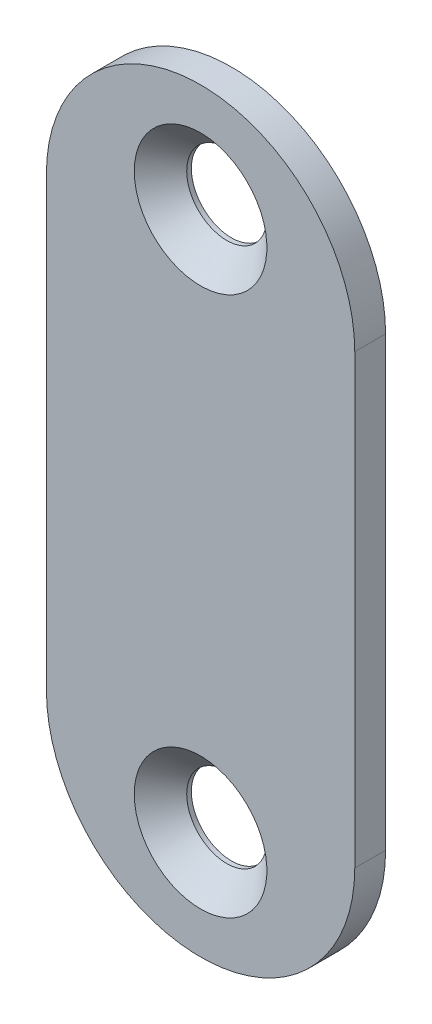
ISO-10303-21;
HEADER;
FILE_DESCRIPTION(('STEP AP214'),'2;1');
FILE_NAME('part.step','',(''),(''),'','','');
FILE_SCHEMA(('AUTOMOTIVE_DESIGN { 1 0 10303 214 1 1 1 1 }'));
ENDSEC;
DATA;
#1=APPLICATION_CONTEXT('core data for automotive mechanical design processes');
#2=APPLICATION_PROTOCOL_DEFINITION('international standard','automotive_design',2000,#1);
#3=PRODUCT_CONTEXT('',#1,'mechanical');
#4=PRODUCT('Part','Part','',(#3));
#5=PRODUCT_RELATED_PRODUCT_CATEGORY('part','',(#4));
#6=PRODUCT_DEFINITION_FORMATION('','',#4);
#7=PRODUCT_DEFINITION_CONTEXT('part definition',#1,'design');
#8=PRODUCT_DEFINITION('design','',#6,#7);
#9=PRODUCT_DEFINITION_SHAPE('','',#8);
#10=(LENGTH_UNIT() NAMED_UNIT(*) SI_UNIT(.MILLI.,.METRE.));
#11=(NAMED_UNIT(*) PLANE_ANGLE_UNIT() SI_UNIT($,.RADIAN.));
#12=(NAMED_UNIT(*) SI_UNIT($,.STERADIAN.) SOLID_ANGLE_UNIT());
#13=UNCERTAINTY_MEASURE_WITH_UNIT(LENGTH_MEASURE(1.E-05),#10,'distance_accuracy_value','');
#14=(GEOMETRIC_REPRESENTATION_CONTEXT(3) GLOBAL_UNCERTAINTY_ASSIGNED_CONTEXT((#13)) GLOBAL_UNIT_ASSIGNED_CONTEXT((#10,
#11,#12)) REPRESENTATION_CONTEXT('',''));
#15=CARTESIAN_POINT('',(0.,0.,0.));
#16=DIRECTION('',(0.,0.,1.));
#17=DIRECTION('',(1.,0.,0.));
#18=AXIS2_PLACEMENT_3D('',#15,#16,#17);
#19=CARTESIAN_POINT('',(0.,-14.5,-2.));
#20=DIRECTION('',(0.,0.,1.));
#21=DIRECTION('',(1.,0.,0.));
#22=AXIS2_PLACEMENT_3D('',#19,#20,#21);
#23=PLANE('',#22);
#24=CARTESIAN_POINT('',(0.,17.5,-2.));
#25=DIRECTION('',(0.,0.,1.));
#26=DIRECTION('',(1.,0.,0.));
#27=AXIS2_PLACEMENT_3D('',#24,#25,#26);
#28=CIRCLE('',#27,2.6);
#29=CARTESIAN_POINT('',(2.6,17.5,-2.));
#30=VERTEX_POINT('',#29);
#31=EDGE_CURVE('E106',#30,#30,#28,.F.);
#32=ORIENTED_EDGE('',*,*,#31,.F.);
#33=EDGE_LOOP('',(#32));
#34=FACE_BOUND('',#33,.T.);
#35=CARTESIAN_POINT('',(0.,-14.5,-2.));
#36=DIRECTION('',(0.,0.,1.));
#37=DIRECTION('',(1.,0.,0.));
#38=AXIS2_PLACEMENT_3D('',#35,#36,#37);
#39=CIRCLE('',#38,10.);
#40=CARTESIAN_POINT('',(-10.,-14.5,-2.));
#41=VERTEX_POINT('',#40);
#42=CARTESIAN_POINT('',(10.,-14.5,-2.));
#43=VERTEX_POINT('',#42);
#44=EDGE_CURVE('E95',#41,#43,#39,.T.);
#45=ORIENTED_EDGE('',*,*,#44,.F.);
#46=DIRECTION('',(0.,-1.,0.));
#47=VECTOR('',#46,1.);
#48=CARTESIAN_POINT('',(-10.,14.5,-2.));
#49=LINE('',#48,#47);
#50=CARTESIAN_POINT('',(-10.,14.5,-2.));
#51=VERTEX_POINT('',#50);
#52=EDGE_CURVE('E92',#51,#41,#49,.T.);
#53=ORIENTED_EDGE('',*,*,#52,.F.);
#54=CARTESIAN_POINT('',(0.,14.5,-2.));
#55=DIRECTION('',(0.,0.,1.));
#56=DIRECTION('',(1.,0.,0.));
#57=AXIS2_PLACEMENT_3D('',#54,#55,#56);
#58=CIRCLE('',#57,10.);
#59=CARTESIAN_POINT('',(10.,14.5,-2.));
#60=VERTEX_POINT('',#59);
#61=EDGE_CURVE('E84',#60,#51,#58,.T.);
#62=ORIENTED_EDGE('',*,*,#61,.F.);
#63=DIRECTION('',(0.,1.,0.));
#64=VECTOR('',#63,1.);
#65=CARTESIAN_POINT('',(10.,-14.5,-2.));
#66=LINE('',#65,#64);
#67=EDGE_CURVE('E91',#43,#60,#66,.T.);
#68=ORIENTED_EDGE('',*,*,#67,.F.);
#69=EDGE_LOOP('',(#45,#53,#62,#68));
#70=FACE_BOUND('',#69,.T.);
#71=CARTESIAN_POINT('',(0.,-17.5,-2.));
#72=DIRECTION('',(0.,0.,1.));
#73=DIRECTION('',(1.,0.,0.));
#74=AXIS2_PLACEMENT_3D('',#71,#72,#73);
#75=CIRCLE('',#74,2.6);
#76=CARTESIAN_POINT('',(2.6,-17.5,-2.));
#77=VERTEX_POINT('',#76);
#78=EDGE_CURVE('E38',#77,#77,#75,.F.);
#79=ORIENTED_EDGE('',*,*,#78,.F.);
#80=EDGE_LOOP('',(#79));
#81=FACE_BOUND('',#80,.T.);
#82=ADVANCED_FACE('F34',(#34,#70,#81),#23,.F.);
#83=CARTESIAN_POINT('',(0.,-14.5,0.));
#84=DIRECTION('',(0.,0.,1.));
#85=DIRECTION('',(1.,0.,0.));
#86=AXIS2_PLACEMENT_3D('',#83,#84,#85);
#87=PLANE('',#86);
#88=CARTESIAN_POINT('',(0.,17.5,0.));
#89=DIRECTION('',(0.,0.,-1.));
#90=DIRECTION('',(-1.,0.,0.));
#91=AXIS2_PLACEMENT_3D('',#88,#89,#90);
#92=CIRCLE('',#91,4.3);
#93=CARTESIAN_POINT('',(-4.3,17.5,0.));
#94=VERTEX_POINT('',#93);
#95=EDGE_CURVE('E117',#94,#94,#92,.T.);
#96=ORIENTED_EDGE('',*,*,#95,.T.);
#97=EDGE_LOOP('',(#96));
#98=FACE_BOUND('',#97,.T.);
#99=CARTESIAN_POINT('',(0.,-14.5,0.));
#100=DIRECTION('',(0.,0.,1.));
#101=DIRECTION('',(1.,0.,0.));
#102=AXIS2_PLACEMENT_3D('',#99,#100,#101);
#103=CIRCLE('',#102,10.);
#104=CARTESIAN_POINT('',(-10.,-14.5,0.));
#105=VERTEX_POINT('',#104);
#106=CARTESIAN_POINT('',(10.,-14.5,0.));
#107=VERTEX_POINT('',#106);
#108=EDGE_CURVE('E102',#105,#107,#103,.T.);
#109=ORIENTED_EDGE('',*,*,#108,.T.);
#110=DIRECTION('',(0.,1.,0.));
#111=VECTOR('',#110,1.);
#112=CARTESIAN_POINT('',(10.,-14.5,0.));
#113=LINE('',#112,#111);
#114=CARTESIAN_POINT('',(10.,14.5,0.));
#115=VERTEX_POINT('',#114);
#116=EDGE_CURVE('E105',#107,#115,#113,.T.);
#117=ORIENTED_EDGE('',*,*,#116,.T.);
#118=CARTESIAN_POINT('',(0.,14.5,0.));
#119=DIRECTION('',(0.,0.,1.));
#120=DIRECTION('',(1.,0.,0.));
#121=AXIS2_PLACEMENT_3D('',#118,#119,#120);
#122=CIRCLE('',#121,10.);
#123=CARTESIAN_POINT('',(-10.,14.5,0.));
#124=VERTEX_POINT('',#123);
#125=EDGE_CURVE('E86',#115,#124,#122,.T.);
#126=ORIENTED_EDGE('',*,*,#125,.T.);
#127=DIRECTION('',(0.,-1.,0.));
#128=VECTOR('',#127,1.);
#129=CARTESIAN_POINT('',(-10.,14.5,0.));
#130=LINE('',#129,#128);
#131=EDGE_CURVE('E97',#124,#105,#130,.T.);
#132=ORIENTED_EDGE('',*,*,#131,.T.);
#133=EDGE_LOOP('',(#109,#117,#126,#132));
#134=FACE_BOUND('',#133,.T.);
#135=CARTESIAN_POINT('',(0.,-17.5,0.));
#136=DIRECTION('',(0.,0.,-1.));
#137=DIRECTION('',(-1.,0.,0.));
#138=AXIS2_PLACEMENT_3D('',#135,#136,#137);
#139=CIRCLE('',#138,4.3);
#140=CARTESIAN_POINT('',(-4.3,-17.5,0.));
#141=VERTEX_POINT('',#140);
#142=EDGE_CURVE('E126',#141,#141,#139,.T.);
#143=ORIENTED_EDGE('',*,*,#142,.T.);
#144=EDGE_LOOP('',(#143));
#145=FACE_BOUND('',#144,.T.);
#146=ADVANCED_FACE('F130',(#98,#134,#145),#87,.T.);
#147=CARTESIAN_POINT('',(0.,-14.5,-2.));
#148=DIRECTION('',(0.,0.,1.));
#149=DIRECTION('',(1.,0.,0.));
#150=AXIS2_PLACEMENT_3D('',#147,#148,#149);
#151=CYLINDRICAL_SURFACE('',#150,10.);
#152=ORIENTED_EDGE('',*,*,#108,.F.);
#153=DIRECTION('',(0.,0.,1.));
#154=VECTOR('',#153,1.);
#155=CARTESIAN_POINT('',(-10.,-14.5,-2.));
#156=LINE('',#155,#154);
#157=EDGE_CURVE('E11',#41,#105,#156,.T.);
#158=ORIENTED_EDGE('',*,*,#157,.F.);
#159=ORIENTED_EDGE('',*,*,#44,.T.);
#160=DIRECTION('',(0.,0.,1.));
#161=VECTOR('',#160,1.);
#162=CARTESIAN_POINT('',(10.,-14.5,-2.));
#163=LINE('',#162,#161);
#164=EDGE_CURVE('E78',#43,#107,#163,.T.);
#165=ORIENTED_EDGE('',*,*,#164,.T.);
#166=EDGE_LOOP('',(#152,#158,#159,#165));
#167=FACE_BOUND('',#166,.T.);
#168=ADVANCED_FACE('F36',(#167),#151,.T.);
#169=CARTESIAN_POINT('',(-10.,14.5,-2.));
#170=DIRECTION('',(-1.,0.,0.));
#171=DIRECTION('',(0.,0.,1.));
#172=AXIS2_PLACEMENT_3D('',#169,#170,#171);
#173=PLANE('',#172);
#174=ORIENTED_EDGE('',*,*,#131,.F.);
#175=DIRECTION('',(0.,0.,1.));
#176=VECTOR('',#175,1.);
#177=CARTESIAN_POINT('',(-10.,14.5,-2.));
#178=LINE('',#177,#176);
#179=EDGE_CURVE('E44',#51,#124,#178,.T.);
#180=ORIENTED_EDGE('',*,*,#179,.F.);
#181=ORIENTED_EDGE('',*,*,#52,.T.);
#182=ORIENTED_EDGE('',*,*,#157,.T.);
#183=EDGE_LOOP('',(#174,#180,#181,#182));
#184=FACE_BOUND('',#183,.T.);
#185=ADVANCED_FACE('F155',(#184),#173,.T.);
#186=CARTESIAN_POINT('',(0.,14.5,-2.));
#187=DIRECTION('',(0.,0.,1.));
#188=DIRECTION('',(1.,0.,0.));
#189=AXIS2_PLACEMENT_3D('',#186,#187,#188);
#190=CYLINDRICAL_SURFACE('',#189,10.);
#191=ORIENTED_EDGE('',*,*,#125,.F.);
#192=DIRECTION('',(0.,0.,1.));
#193=VECTOR('',#192,1.);
#194=CARTESIAN_POINT('',(10.,14.5,-2.));
#195=LINE('',#194,#193);
#196=EDGE_CURVE('E81',#60,#115,#195,.T.);
#197=ORIENTED_EDGE('',*,*,#196,.F.);
#198=ORIENTED_EDGE('',*,*,#61,.T.);
#199=ORIENTED_EDGE('',*,*,#179,.T.);
#200=EDGE_LOOP('',(#191,#197,#198,#199));
#201=FACE_BOUND('',#200,.T.);
#202=ADVANCED_FACE('F83',(#201),#190,.T.);
#203=CARTESIAN_POINT('',(10.,-14.5,-2.));
#204=DIRECTION('',(1.,0.,0.));
#205=DIRECTION('',(0.,0.,-1.));
#206=AXIS2_PLACEMENT_3D('',#203,#204,#205);
#207=PLANE('',#206);
#208=ORIENTED_EDGE('',*,*,#116,.F.);
#209=ORIENTED_EDGE('',*,*,#164,.F.);
#210=ORIENTED_EDGE('',*,*,#67,.T.);
#211=ORIENTED_EDGE('',*,*,#196,.T.);
#212=EDGE_LOOP('',(#208,#209,#210,#211));
#213=FACE_BOUND('',#212,.T.);
#214=ADVANCED_FACE('F94',(#213),#207,.T.);
#215=CARTESIAN_POINT('',(0.,17.5,0.));
#216=DIRECTION('',(0.,0.,-1.));
#217=DIRECTION('',(-1.,0.,0.));
#218=AXIS2_PLACEMENT_3D('',#215,#216,#217);
#219=CYLINDRICAL_SURFACE('',#218,2.6);
#220=CARTESIAN_POINT('',(0.,17.5,-1.7));
#221=DIRECTION('',(0.,0.,-1.));
#222=DIRECTION('',(-1.,0.,0.));
#223=AXIS2_PLACEMENT_3D('',#220,#221,#222);
#224=CIRCLE('',#223,2.6);
#225=CARTESIAN_POINT('',(-2.6,17.5,-1.7));
#226=VERTEX_POINT('',#225);
#227=EDGE_CURVE('E113',#226,#226,#224,.T.);
#228=ORIENTED_EDGE('',*,*,#227,.F.);
#229=EDGE_LOOP('',(#228));
#230=FACE_BOUND('',#229,.T.);
#231=ORIENTED_EDGE('',*,*,#31,.T.);
#232=EDGE_LOOP('',(#231));
#233=FACE_BOUND('',#232,.T.);
#234=ADVANCED_FACE('F152',(#230,#233),#219,.F.);
#235=CARTESIAN_POINT('',(0.,17.5,0.));
#236=DIRECTION('',(0.,0.,1.));
#237=DIRECTION('',(1.,0.,0.));
#238=AXIS2_PLACEMENT_3D('',#235,#236,#237);
#239=CONICAL_SURFACE('',#238,4.3,0.785398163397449);
#240=ORIENTED_EDGE('',*,*,#227,.T.);
#241=EDGE_LOOP('',(#240));
#242=FACE_BOUND('',#241,.T.);
#243=ORIENTED_EDGE('',*,*,#95,.F.);
#244=EDGE_LOOP('',(#243));
#245=FACE_BOUND('',#244,.T.);
#246=ADVANCED_FACE('F140',(#242,#245),#239,.F.);
#247=CARTESIAN_POINT('',(0.,-17.5,0.));
#248=DIRECTION('',(0.,0.,-1.));
#249=DIRECTION('',(-1.,0.,0.));
#250=AXIS2_PLACEMENT_3D('',#247,#248,#249);
#251=CYLINDRICAL_SURFACE('',#250,2.6);
#252=CARTESIAN_POINT('',(0.,-17.5,-1.69999999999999));
#253=DIRECTION('',(0.,0.,-1.));
#254=DIRECTION('',(-1.,0.,0.));
#255=AXIS2_PLACEMENT_3D('',#252,#253,#254);
#256=CIRCLE('',#255,2.6);
#257=CARTESIAN_POINT('',(-2.6,-17.5,-1.69999999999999));
#258=VERTEX_POINT('',#257);
#259=EDGE_CURVE('E123',#258,#258,#256,.T.);
#260=ORIENTED_EDGE('',*,*,#259,.F.);
#261=EDGE_LOOP('',(#260));
#262=FACE_BOUND('',#261,.T.);
#263=ORIENTED_EDGE('',*,*,#78,.T.);
#264=EDGE_LOOP('',(#263));
#265=FACE_BOUND('',#264,.T.);
#266=ADVANCED_FACE('F134',(#262,#265),#251,.F.);
#267=CARTESIAN_POINT('',(0.,-17.5,0.));
#268=DIRECTION('',(0.,0.,1.));
#269=DIRECTION('',(1.,0.,0.));
#270=AXIS2_PLACEMENT_3D('',#267,#268,#269);
#271=CONICAL_SURFACE('',#270,4.3,0.785398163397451);
#272=ORIENTED_EDGE('',*,*,#259,.T.);
#273=EDGE_LOOP('',(#272));
#274=FACE_BOUND('',#273,.T.);
#275=ORIENTED_EDGE('',*,*,#142,.F.);
#276=EDGE_LOOP('',(#275));
#277=FACE_BOUND('',#276,.T.);
#278=ADVANCED_FACE('F132',(#274,#277),#271,.F.);
#279=CLOSED_SHELL('',(#82,#146,#168,#185,#202,#214,#234,#246,#266,#278));
#280=MANIFOLD_SOLID_BREP('B2',#279);
#281=ADVANCED_BREP_SHAPE_REPRESENTATION('',(#18,#280),#14);
#282=SHAPE_DEFINITION_REPRESENTATION(#9,#281);
ENDSEC;
END-ISO-10303-21;
